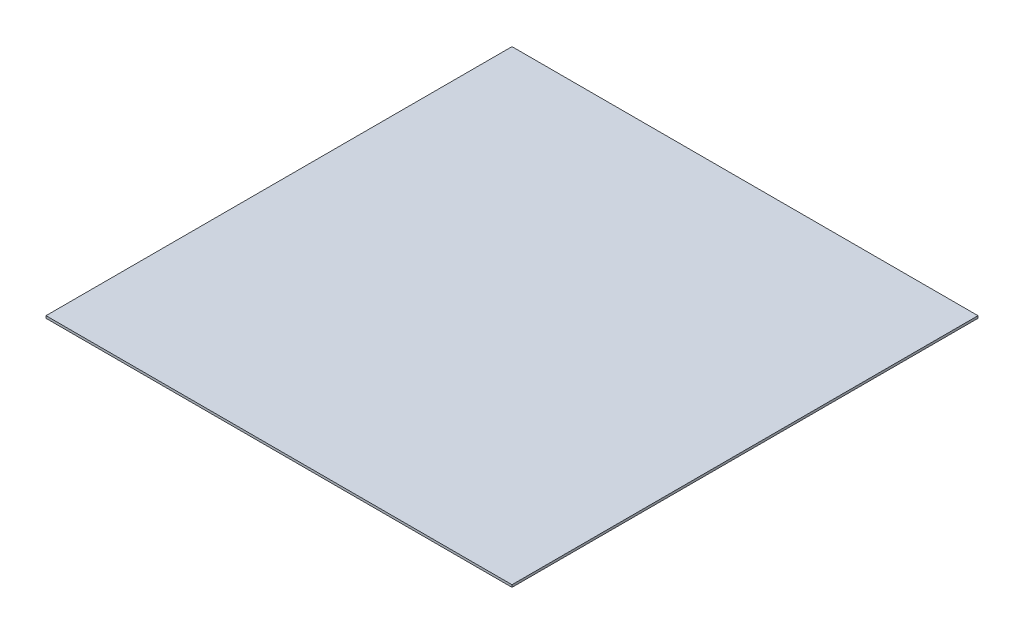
ISO-10303-21;
HEADER;
FILE_DESCRIPTION(('STEP AP214'),'2;1');
FILE_NAME('part.step','',(''),(''),'','','');
FILE_SCHEMA(('AUTOMOTIVE_DESIGN { 1 0 10303 214 1 1 1 1 }'));
ENDSEC;
DATA;
#1=APPLICATION_CONTEXT('core data for automotive mechanical design processes');
#2=APPLICATION_PROTOCOL_DEFINITION('international standard','automotive_design',2000,#1);
#3=PRODUCT_CONTEXT('',#1,'mechanical');
#4=PRODUCT('Part','Part','',(#3));
#5=PRODUCT_RELATED_PRODUCT_CATEGORY('part','',(#4));
#6=PRODUCT_DEFINITION_FORMATION('','',#4);
#7=PRODUCT_DEFINITION_CONTEXT('part definition',#1,'design');
#8=PRODUCT_DEFINITION('design','',#6,#7);
#9=PRODUCT_DEFINITION_SHAPE('','',#8);
#10=(LENGTH_UNIT() NAMED_UNIT(*) SI_UNIT(.MILLI.,.METRE.));
#11=(NAMED_UNIT(*) PLANE_ANGLE_UNIT() SI_UNIT($,.RADIAN.));
#12=(NAMED_UNIT(*) SI_UNIT($,.STERADIAN.) SOLID_ANGLE_UNIT());
#13=UNCERTAINTY_MEASURE_WITH_UNIT(LENGTH_MEASURE(1.E-05),#10,'distance_accuracy_value','');
#14=(GEOMETRIC_REPRESENTATION_CONTEXT(3) GLOBAL_UNCERTAINTY_ASSIGNED_CONTEXT((#13)) GLOBAL_UNIT_ASSIGNED_CONTEXT((#10,
#11,#12)) REPRESENTATION_CONTEXT('',''));
#15=CARTESIAN_POINT('',(0.,0.,0.));
#16=DIRECTION('',(0.,0.,1.));
#17=DIRECTION('',(1.,0.,0.));
#18=AXIS2_PLACEMENT_3D('',#15,#16,#17);
#19=CARTESIAN_POINT('',(0.,5.,0.));
#20=DIRECTION('',(1.,0.,0.));
#21=DIRECTION('',(0.,0.,-1.));
#22=AXIS2_PLACEMENT_3D('',#19,#20,#21);
#23=PLANE('',#22);
#24=DIRECTION('',(0.,0.,1.));
#25=VECTOR('',#24,1.);
#26=CARTESIAN_POINT('',(0.,0.,0.));
#27=LINE('',#26,#25);
#28=CARTESIAN_POINT('',(0.,0.,-1000.));
#29=VERTEX_POINT('',#28);
#30=CARTESIAN_POINT('',(0.,0.,0.));
#31=VERTEX_POINT('',#30);
#32=EDGE_CURVE('E97',#29,#31,#27,.T.);
#33=ORIENTED_EDGE('',*,*,#32,.T.);
#34=DIRECTION('',(0.,-1.,0.));
#35=VECTOR('',#34,1.);
#36=CARTESIAN_POINT('',(0.,5.,0.));
#37=LINE('',#36,#35);
#38=CARTESIAN_POINT('',(0.,5.,0.));
#39=VERTEX_POINT('',#38);
#40=EDGE_CURVE('E11',#39,#31,#37,.T.);
#41=ORIENTED_EDGE('',*,*,#40,.F.);
#42=DIRECTION('',(0.,0.,1.));
#43=VECTOR('',#42,1.);
#44=CARTESIAN_POINT('',(0.,5.,0.));
#45=LINE('',#44,#43);
#46=CARTESIAN_POINT('',(0.,5.,-1000.));
#47=VERTEX_POINT('',#46);
#48=EDGE_CURVE('E85',#47,#39,#45,.T.);
#49=ORIENTED_EDGE('',*,*,#48,.F.);
#50=DIRECTION('',(0.,-1.,0.));
#51=VECTOR('',#50,1.);
#52=CARTESIAN_POINT('',(0.,5.,-1000.));
#53=LINE('',#52,#51);
#54=EDGE_CURVE('E93',#47,#29,#53,.T.);
#55=ORIENTED_EDGE('',*,*,#54,.T.);
#56=EDGE_LOOP('',(#33,#41,#49,#55));
#57=FACE_BOUND('',#56,.T.);
#58=ADVANCED_FACE('F34',(#57),#23,.F.);
#59=CARTESIAN_POINT('',(0.,5.,0.));
#60=DIRECTION('',(0.,0.,-1.));
#61=DIRECTION('',(-1.,0.,0.));
#62=AXIS2_PLACEMENT_3D('',#59,#60,#61);
#63=PLANE('',#62);
#64=DIRECTION('',(1.,0.,0.));
#65=VECTOR('',#64,1.);
#66=CARTESIAN_POINT('',(0.,0.,0.));
#67=LINE('',#66,#65);
#68=CARTESIAN_POINT('',(1000.,0.,0.));
#69=VERTEX_POINT('',#68);
#70=EDGE_CURVE('E89',#31,#69,#67,.T.);
#71=ORIENTED_EDGE('',*,*,#70,.T.);
#72=DIRECTION('',(0.,-1.,0.));
#73=VECTOR('',#72,1.);
#74=CARTESIAN_POINT('',(1000.,5.,0.));
#75=LINE('',#74,#73);
#76=CARTESIAN_POINT('',(1000.,5.,0.));
#77=VERTEX_POINT('',#76);
#78=EDGE_CURVE('E42',#77,#69,#75,.T.);
#79=ORIENTED_EDGE('',*,*,#78,.F.);
#80=DIRECTION('',(1.,0.,0.));
#81=VECTOR('',#80,1.);
#82=CARTESIAN_POINT('',(0.,5.,0.));
#83=LINE('',#82,#81);
#84=EDGE_CURVE('E80',#39,#77,#83,.T.);
#85=ORIENTED_EDGE('',*,*,#84,.F.);
#86=ORIENTED_EDGE('',*,*,#40,.T.);
#87=EDGE_LOOP('',(#71,#79,#85,#86));
#88=FACE_BOUND('',#87,.T.);
#89=ADVANCED_FACE('F88',(#88),#63,.F.);
#90=CARTESIAN_POINT('',(1000.,5.,0.));
#91=DIRECTION('',(-1.,0.,0.));
#92=DIRECTION('',(0.,0.,1.));
#93=AXIS2_PLACEMENT_3D('',#90,#91,#92);
#94=PLANE('',#93);
#95=DIRECTION('',(0.,0.,-1.));
#96=VECTOR('',#95,1.);
#97=CARTESIAN_POINT('',(1000.,0.,0.));
#98=LINE('',#97,#96);
#99=CARTESIAN_POINT('',(1000.,0.,-1000.));
#100=VERTEX_POINT('',#99);
#101=EDGE_CURVE('E67',#69,#100,#98,.T.);
#102=ORIENTED_EDGE('',*,*,#101,.T.);
#103=DIRECTION('',(0.,-1.,0.));
#104=VECTOR('',#103,1.);
#105=CARTESIAN_POINT('',(1000.,5.,-1000.));
#106=LINE('',#105,#104);
#107=CARTESIAN_POINT('',(1000.,5.,-1000.));
#108=VERTEX_POINT('',#107);
#109=EDGE_CURVE('E90',#108,#100,#106,.T.);
#110=ORIENTED_EDGE('',*,*,#109,.F.);
#111=DIRECTION('',(0.,0.,-1.));
#112=VECTOR('',#111,1.);
#113=CARTESIAN_POINT('',(1000.,5.,0.));
#114=LINE('',#113,#112);
#115=EDGE_CURVE('E83',#77,#108,#114,.T.);
#116=ORIENTED_EDGE('',*,*,#115,.F.);
#117=ORIENTED_EDGE('',*,*,#78,.T.);
#118=EDGE_LOOP('',(#102,#110,#116,#117));
#119=FACE_BOUND('',#118,.T.);
#120=ADVANCED_FACE('F91',(#119),#94,.F.);
#121=CARTESIAN_POINT('',(0.,5.,-1000.));
#122=DIRECTION('',(0.,0.,1.));
#123=DIRECTION('',(1.,0.,0.));
#124=AXIS2_PLACEMENT_3D('',#121,#122,#123);
#125=PLANE('',#124);
#126=DIRECTION('',(-1.,0.,0.));
#127=VECTOR('',#126,1.);
#128=CARTESIAN_POINT('',(0.,0.,-1000.));
#129=LINE('',#128,#127);
#130=EDGE_CURVE('E73',#100,#29,#129,.T.);
#131=ORIENTED_EDGE('',*,*,#130,.T.);
#132=ORIENTED_EDGE('',*,*,#54,.F.);
#133=DIRECTION('',(-1.,0.,0.));
#134=VECTOR('',#133,1.);
#135=CARTESIAN_POINT('',(0.,5.,-1000.));
#136=LINE('',#135,#134);
#137=EDGE_CURVE('E50',#108,#47,#136,.T.);
#138=ORIENTED_EDGE('',*,*,#137,.F.);
#139=ORIENTED_EDGE('',*,*,#109,.T.);
#140=EDGE_LOOP('',(#131,#132,#138,#139));
#141=FACE_BOUND('',#140,.T.);
#142=ADVANCED_FACE('F104',(#141),#125,.F.);
#143=CARTESIAN_POINT('',(0.,5.,0.));
#144=DIRECTION('',(0.,-1.,0.));
#145=DIRECTION('',(0.,0.,-1.));
#146=AXIS2_PLACEMENT_3D('',#143,#144,#145);
#147=PLANE('',#146);
#148=ORIENTED_EDGE('',*,*,#48,.T.);
#149=ORIENTED_EDGE('',*,*,#84,.T.);
#150=ORIENTED_EDGE('',*,*,#115,.T.);
#151=ORIENTED_EDGE('',*,*,#137,.T.);
#152=EDGE_LOOP('',(#148,#149,#150,#151));
#153=FACE_BOUND('',#152,.T.);
#154=ADVANCED_FACE('F81',(#153),#147,.F.);
#155=CARTESIAN_POINT('',(0.,0.,0.));
#156=DIRECTION('',(0.,-1.,0.));
#157=DIRECTION('',(0.,0.,-1.));
#158=AXIS2_PLACEMENT_3D('',#155,#156,#157);
#159=PLANE('',#158);
#160=ORIENTED_EDGE('',*,*,#32,.F.);
#161=ORIENTED_EDGE('',*,*,#130,.F.);
#162=ORIENTED_EDGE('',*,*,#101,.F.);
#163=ORIENTED_EDGE('',*,*,#70,.F.);
#164=EDGE_LOOP('',(#160,#161,#162,#163));
#165=FACE_BOUND('',#164,.T.);
#166=ADVANCED_FACE('F107',(#165),#159,.T.);
#167=CLOSED_SHELL('',(#58,#89,#120,#142,#154,#166));
#168=MANIFOLD_SOLID_BREP('B2',#167);
#169=ADVANCED_BREP_SHAPE_REPRESENTATION('',(#18,#168),#14);
#170=SHAPE_DEFINITION_REPRESENTATION(#9,#169);
ENDSEC;
END-ISO-10303-21;
